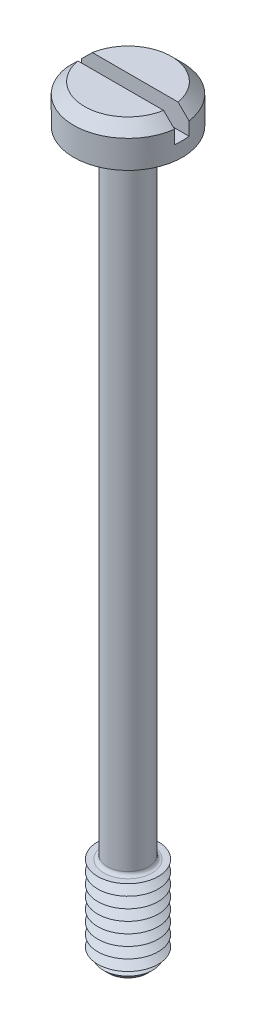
from build123d import *

# Parameters (mm, degrees)
SKETCH1_R           = 2.25
BOSS_EXTRUDE1_DEPTH = 1.6
SKETCH2_R           = 0.85
BOSS_EXTRUDE2_DEPTH = 30
SKETCH3_R           = 1.25
BOSS_EXTRUDE3_DEPTH = 3.7
CHAMFER1_SIZE       = 0.45
LPATTERN1_COUNT     = 8
LPATTERN1_PITCH     = 0.45
FILLET1_R           = 0.15
CHAMFER2_SIZE       = 0.45
SKETCH6_W           = 4.5
SKETCH6_H           = 0.6
CUT_EXTRUDE1_DEPTH  = 1


with BuildPart() as part:
    # Sketch1 → Boss-Extrude1 (new body)
    with BuildSketch(Plane(origin=(0, 0, 0), x_dir=(1, 0, 0), z_dir=(0, 1, 0))):
        with Locations(Location((0, 0, 0), (0, 0, 270))):
            Circle(SKETCH1_R)
    extrude(amount=BOSS_EXTRUDE1_DEPTH)

    # Sketch2 → Boss-Extrude2 (add)
    with BuildSketch(Plane.XZ):
        with Locations(Location((0, 0, 0), (0, 0, 270))):
            Circle(SKETCH2_R)
    extrude(amount=BOSS_EXTRUDE2_DEPTH)

    # Sketch3 → Boss-Extrude3 (add)
    with BuildSketch(Plane.XZ.offset(30)):
        with Locations(Location((0, 0, 0), (0, 0, 270))):
            Circle(SKETCH3_R)
    extrude(amount=-BOSS_EXTRUDE3_DEPTH)

    # Chamfer1
    chamfer1_edges = [part.edges().sort_by_distance(p)[0] for p in [
        (0, -30, 1.25),
    ]]
    chamfer(chamfer1_edges, length=CHAMFER1_SIZE)

    # Sketch5 → Cut-Revolve1 (revolve, cut)
    with BuildSketch(Plane(origin=(0, 0, 0), x_dir=(0, 0, -1), z_dir=(1, 0, 0))):
        Polygon((-1.25, -26.3), (-0.860288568, -26.525), (-1.25, -26.75), align=None)
    cut_revolve1 = revolve(axis=Axis((0, -6.58711856, 0), (0, -1, 0)), mode=Mode.SUBTRACT)

    # LPattern1: Cut-Revolve1 ×8
    with Locations(*[(0, -i * LPATTERN1_PITCH, 0) for i in range(1, LPATTERN1_COUNT)]):
        add(cut_revolve1, mode=Mode.SUBTRACT)

    # Fillet1
    fillet1_edges = [part.edges().sort_by_distance(p)[0] for p in [
        (0, 0, 0.85),
        (0, -26.3, 0.85),
    ]]
    fillet(fillet1_edges, radius=FILLET1_R)

    # Chamfer2
    chamfer2_edges = [part.edges().sort_by_distance(p)[0] for p in [
        (0, 1.6, -2.25),
    ]]
    chamfer(chamfer2_edges, length=CHAMFER2_SIZE)

    # Sketch6 → Cut-Extrude1 (cut)
    with BuildSketch(Plane(origin=(0, 1.6, 0), x_dir=(1, 0, 0), z_dir=(0, 1, 0))):
        Rectangle(SKETCH6_W, SKETCH6_H)
    extrude(amount=-CUT_EXTRUDE1_DEPTH, mode=Mode.SUBTRACT)


solid = part.part
